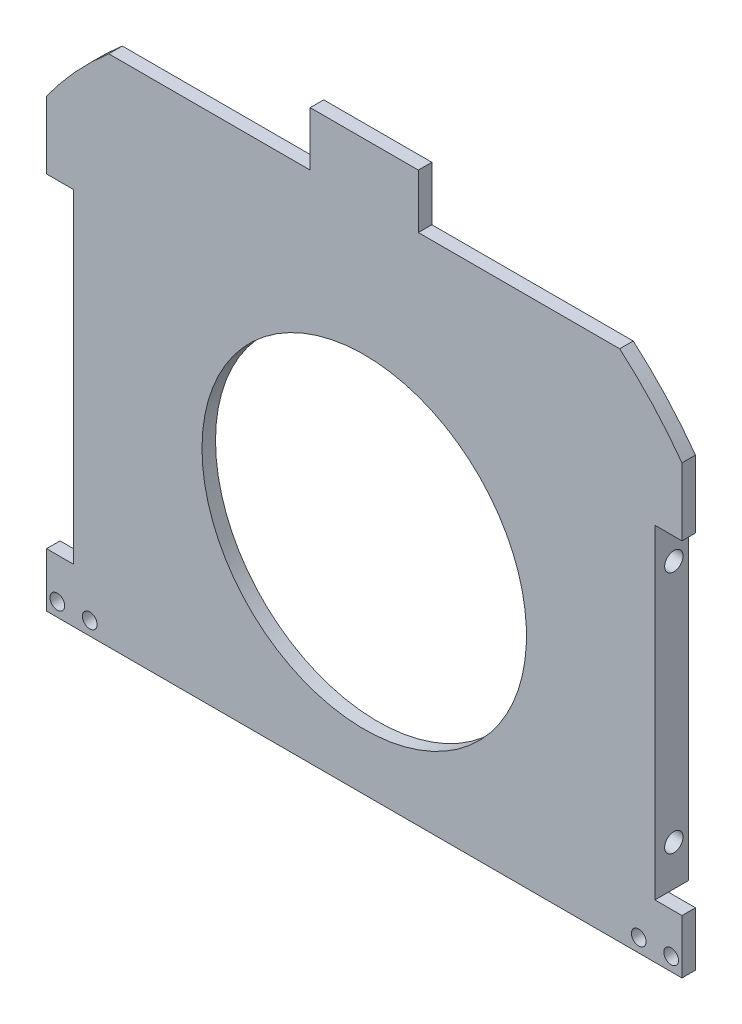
from build123d import *

# Parameters (mm, degrees)
SKETCH1_R           = 1.7272
BASE_EXTRUDE_DEPTH  = 3.175
SKETCH2_W           = 4.7625
SKETCH2_H           = 76.2
BOSS_EXTRUDE1_DEPTH = 4.7625
SKETCH3_R           = 38.1
BIG_HOLE_DEPTH      = 109.241426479
SKETCH4_R           = 2.159
CUT_EXTRUDE2_DEPTH  = 6.35
CUT_EXTRUDE3_START  = -6.35
SKETCH5_R           = 2.159
CUT_EXTRUDE3_DEPTH  = 6.35


with BuildPart() as part:
    # Sketch1 → Base-Extrude (new body)
    with BuildSketch(Plane.XY):
        with BuildLine():
            Line((76.2, 25.4), (76.2, -50.8))
            Line((76.2, -50.8), (82.55, -50.8))
            Line((82.55, -50.8), (82.55, -63.5))
            Line((82.55, -63.5), (-66.675, -63.5))
            Line((-66.675, -63.5), (-66.675, -50.8))
            Line((-66.675, -50.8), (-60.325, -50.8))
            Line((-60.325, -50.8), (-60.325, 25.4))
            Line((-60.325, 25.4), (-66.675, 25.4))
            Line((-66.675, 25.4), (-66.675, 41.251649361))
            ThreePointArc((-66.675, 41.251649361), (-59.831505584, 49.631111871), (-52.052358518, 57.15))
            Line((-52.052358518, 57.15), (-4.7625, 57.15))
            Line((-4.7625, 57.15), (-4.7625, 69.85))
            Line((-4.7625, 69.85), (20.6375, 69.85))
            Line((20.6375, 69.85), (20.6375, 57.15))
            Line((20.6375, 57.15), (67.927358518, 57.15))
            ThreePointArc((67.927358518, 57.15), (75.706505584, 49.631111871), (82.55, 41.251649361))
            Line((82.55, 41.251649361), (82.55, 25.4))
            Line((82.55, 25.4), (76.2, 25.4))
        make_face()
        with Locations((-64.135, -60.303321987)):
            Circle(SKETCH1_R, mode=Mode.SUBTRACT)
        with Locations((-56.515, -60.303321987)):
            Circle(SKETCH1_R, mode=Mode.SUBTRACT)
        with Locations((80.01, -60.346678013)):
            Circle(SKETCH1_R, mode=Mode.SUBTRACT)
        with Locations((72.39, -60.346678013)):
            Circle(SKETCH1_R, mode=Mode.SUBTRACT)
    extrude(amount=BASE_EXTRUDE_DEPTH)

    # Sketch2 → Boss-Extrude1 (add)
    with BuildSketch(Plane(origin=(0, 0, 0), x_dir=(-1, 0, 0), z_dir=(0, 0, -1))):
        with Locations((57.94375, -12.7)):
            Rectangle(SKETCH2_W, SKETCH2_H)
        with Locations((-73.81875, -12.7)):
            Rectangle(SKETCH2_W, SKETCH2_H)
    extrude(amount=BOSS_EXTRUDE1_DEPTH)

    # Sketch3 → big hole (cut, through all)
    with BuildSketch(Plane(origin=(0, 0, 0), x_dir=(-1, 0, 0), z_dir=(0, 0, -1))):
        with Locations((-7.9375, -12.142428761)):
            Circle(SKETCH3_R)
    extrude(amount=-BIG_HOLE_DEPTH, mode=Mode.SUBTRACT)

    # Sketch4 → Cut-Extrude2 (cut)
    with BuildSketch(Plane.ZY.offset(60.325)):
        with Locations(Location((-1.27, 15.875, 0), (0, 0, 270))):
            Circle(SKETCH4_R)
        with Locations(Location((-1.27, -41.275, 0), (0, 0, 270))):
            Circle(SKETCH4_R)
    extrude(amount=-CUT_EXTRUDE2_DEPTH, mode=Mode.SUBTRACT)

    # Sketch5 → Cut-Extrude3 (cut)
    with BuildSketch(Plane(origin=(76.2, 0, 0), x_dir=(0, 0, -1), z_dir=(1, 0, 0)).offset(CUT_EXTRUDE3_START)):
        with Locations(Location((1.27, -41.275, 0), (0, 0, 270))):
            Circle(SKETCH5_R)
        with Locations(Location((1.27, 15.875, 0), (0, 0, 270))):
            Circle(SKETCH5_R)
    extrude(amount=CUT_EXTRUDE3_DEPTH, mode=Mode.SUBTRACT)


solid = part.part
